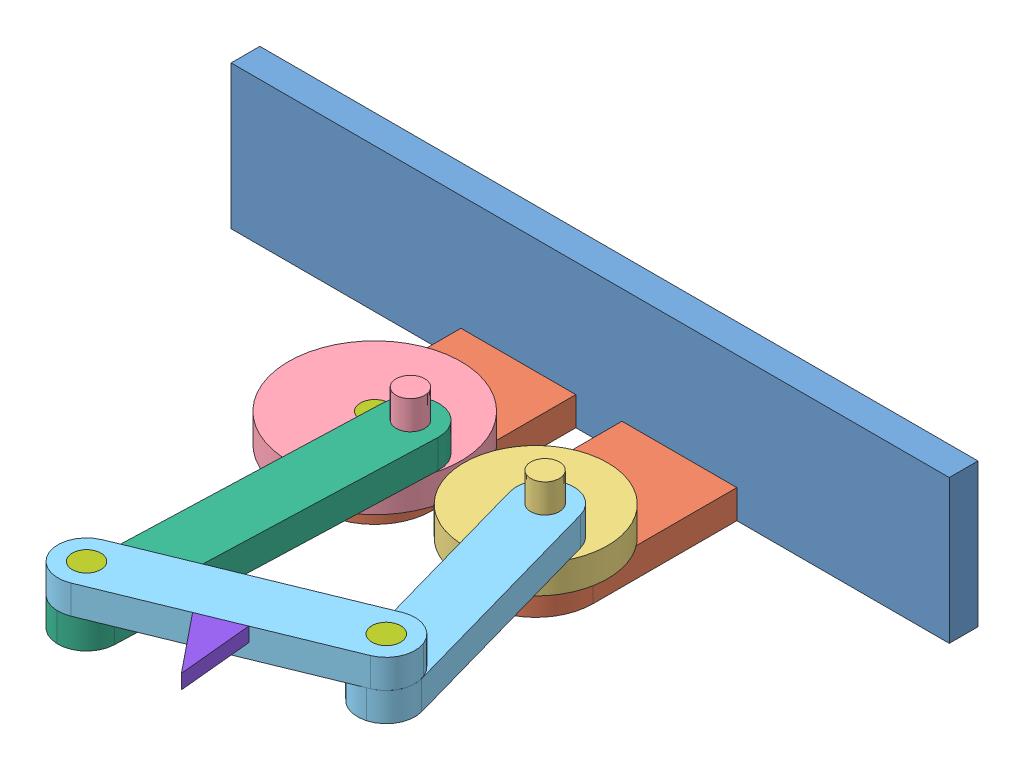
SolidWorks assembly pape114_3.SLDASM, configuration Default (file format 6000). Lengths in mm.
Overall size (250 50 195.52).
13 component instances, 8 part files, 29 mates.
Components (placement in the parent):
- BASE-1: BASE.SLDPRT [Default] at (-20.7654 104.7281 181.6357) size (250 50 10)
- base1-1: base1.SLDPRT [Default] at (115.2887 114.7281 191.6357) x (1 0 0) z (0 -1 0) size (40 70 10)
- drive-1: drive.SLDPRT [Default] at (135.2887 114.7281 241.6357) x (-0.581995 0 0.813192) z (0 1 0) size (50 50 30)
- base1-2: base1.SLDPRT [Default] at (59.2346 114.7281 191.6357) x (1 0 0) z (0 -1 0) size (40 70 10)
- drive2-1: drive2.SLDPRT [Default] at (79.2346 114.7281 241.6357) x (-0.324256 0 0.945969) z (0 1 0) size (60 60 30)
- arm1-1: arm1.SLDPRT [Default] at (180.7292 124.7281 333.6896) x (-0.271459 0 -0.96245) z (0 1 0) size (100 20 10)
- arm2-1: arm2.SLDPRT [Default] at (103.9837 124.7281 367.3979) x (0.034993 0 -0.999388) z (0 1 0) size (129 20 10)
- arm1-2: arm1.SLDPRT [Default] at (88.8678 134.7281 370.0947) x (0.92563 0 -0.37843) z (0 1 0) size (100 20 10)
- pin-1: pin.SLDPRT [Default] at (94.3398 124.7281 357.0541) x (-0.760918 0 0.648848) z (-0.648848 0 -0.760918) size (10 20 10)
- pin-2: pin.SLDPRT [Default] at (168.3901 124.7281 326.7797) x (0.773063 0 -0.634329) z (0.634329 0 0.773063) size (10 20 10)
- pin-3: pin.SLDPRT [Default] at (79.2346 104.7281 241.6357) size (10 20 10)
- pin-4: pin.SLDPRT [Default] at (135.2887 104.7281 241.6357) size (10 20 10)
- markerTriangle-1: markerTriangle.SLDPRT [Default] at (128.207 144.7281 354.0114) x (0.92563 0 -0.37843) z (0 -1 0) size (15 25 5)
Mates (geometry in assembly coordinates):
- Coincident1: coincident anti-aligned: plane of BASE-1 through (-20.7654 104.7281 191.6357) normal (0 0 1); plane of base1-1 through (155.2887 104.7281 191.6357) normal (0 0 -1)
- Coincident2: coincident aligned: line of BASE-1 through (-20.7654 104.7281 191.6357) axis (1 0 0); line of base1-1 through (115.2887 104.7281 191.6357) axis (1 0 0)
- Coincident5: coincident anti-aligned: plane of base1-1 through (135.2887 114.7281 241.6357) normal (0 1 0); plane of drive-1 through (135.2887 114.7281 241.6357) normal (0 -1 0)
- Concentric1: concentric anti-aligned: cylinder of base1-1 through (135.2887 114.7281 241.6357) axis (0 -1 0) radius 5; cylinder of drive-1 through (135.2887 114.7281 241.6357) axis (0 1 0) radius 5
- Coincident6: coincident anti-aligned: plane of BASE-1 through (-20.7654 104.7281 191.6357) normal (0 0 1); plane of base1-2 through (99.2346 104.7281 191.6357) normal (0 0 -1)
- Coincident7: coincident aligned: line of BASE-1 through (-20.7654 104.7281 191.6357) axis (1 0 0); line of base1-2 through (59.2346 104.7281 191.6357) axis (1 0 0)
- Distance1: distance = 80 mm: line of BASE-1 through (-20.7654 154.7281 191.6357) axis (0 -1 0); line of base1-2 through (59.2346 104.7281 191.6357) axis (0 1 0)
- Concentric3: concentric anti-aligned: cylinder of base1-2 through (79.2346 114.7281 241.6357) axis (0 -1 0) radius 5; cylinder of drive2-1 through (79.2346 114.7281 241.6357) axis (0 1 0) radius 5
- Coincident9: coincident anti-aligned: plane of base1-2 through (79.2346 114.7281 241.6357) normal (0 1 0); plane of drive2-1 through (79.2346 114.7281 241.6357) normal (0 -1 0)
- Concentric4: concentric anti-aligned: cylinder of drive-1 through (146.6734 144.7281 249.7837) axis (0 -1 0) radius 5; cylinder of arm1-1 through (146.6734 124.7281 249.7837) axis (0 1 0) radius 5
- Coincident10: coincident anti-aligned: plane of drive-1 through (135.2887 124.7281 241.6357) normal (0 1 0); plane of arm1-1 through (180.7292 124.7281 333.6896) normal (0 -1 0)
- Concentric5: concentric anti-aligned: cylinder of drive2-1 through (98.154 144.7281 248.1209) axis (0 -1 0) radius 5; cylinder of arm2-1 through (98.154 124.7281 248.1209) axis (0 1 0) radius 5
- Coincident11: coincident anti-aligned: plane of drive2-1 through (79.2346 124.7281 241.6357) normal (0 1 0); plane of arm2-1 through (103.9837 124.7281 367.3979) normal (0 -1 0)
- Concentric6: concentric aligned: cylinder of arm1-1 through (168.3901 124.7281 326.7797) axis (0 1 0) radius 5; cylinder of arm1-2 through (168.3901 134.7281 326.7797) axis (0 1 0) radius 5
- Concentric7: concentric aligned: cylinder of arm2-1 through (94.3398 124.7281 357.0541) axis (0 1 0) radius 5; cylinder of arm1-2 through (94.3398 134.7281 357.0541) axis (0 1 0) radius 5
- GearMate1: gear = 60 mm: cylinder of drive-1 through (135.2887 124.7281 241.6357) axis (0 -1 0) radius 25; cylinder of drive2-1 through (79.2346 124.7281 241.6357) axis (0 -1 0) radius 30
- Coincident12: coincident anti-aligned: plane of arm1-1 through (180.7292 134.7281 333.6896) normal (0 1 0); plane of arm1-2 through (88.8678 134.7281 370.0947) normal (0 -1 0)
- Distance2: distance = 73.9459 mm: line of base1-1 through (155.2887 104.7281 191.6357) axis (0 1 0); line of BASE-1 through (229.2346 104.7281 191.6357) axis (0 1 0)
- Concentric8: concentric anti-aligned: cylinder of arm1-2 through (168.3901 134.7281 326.7797) axis (0 1 0) radius 5; cylinder of pin-2 through (168.3901 144.7281 326.7797) axis (0 -1 0) radius 5
- Coincident13: coincident aligned: plane of arm1-2 through (88.8678 144.7281 370.0947) normal (0 1 0); plane of pin-2 through (168.3901 144.7281 326.7797) normal (0 1 0)
- Concentric9: concentric anti-aligned: cylinder of arm1-2 through (94.3398 134.7281 357.0541) axis (0 1 0) radius 5; cylinder of pin-1 through (94.3398 144.7281 357.0541) axis (0 -1 0) radius 5
- Coincident14: coincident aligned: plane of arm1-2 through (88.8678 144.7281 370.0947) normal (0 1 0); plane of pin-1 through (94.3398 144.7281 357.0541) normal (0 1 0)
- Concentric10: concentric anti-aligned: cylinder of drive-1 through (135.2887 114.7281 241.6357) axis (0 1 0) radius 5; cylinder of pin-4 through (135.2887 124.7281 241.6357) axis (0 -1 0) radius 5
- Coincident15: coincident aligned: plane of drive-1 through (135.2887 124.7281 241.6357) normal (0 1 0); plane of pin-4 through (135.2887 124.7281 241.6357) normal (0 1 0)
- Concentric11: concentric anti-aligned: cylinder of drive2-1 through (79.2346 114.7281 241.6357) axis (0 1 0) radius 5; cylinder of pin-3 through (79.2346 124.7281 241.6357) axis (0 -1 0) radius 5
- Coincident16: coincident aligned: plane of drive2-1 through (79.2346 124.7281 241.6357) normal (0 1 0); plane of pin-3 through (79.2346 124.7281 241.6357) normal (0 1 0)
- Coincident17: coincident anti-aligned: plane of arm1-2 through (88.8678 144.7281 370.0947) normal (0.37843 0 0.92563); plane of markerTriangle-1 through (142.0915 139.7281 348.335) normal (-0.37843 0 -0.92563)
- Coincident18: coincident aligned: line of arm1-2 through (98.1241 144.7281 366.3104) axis (0.92563 0 -0.37843); line of markerTriangle-1 through (128.207 144.7281 354.0114) axis (0.92563 0 -0.37843)
- Coincident19: coincident: moEndPointRef_w of arm1-2; moEndPointRef_w of markerTriangle-1
